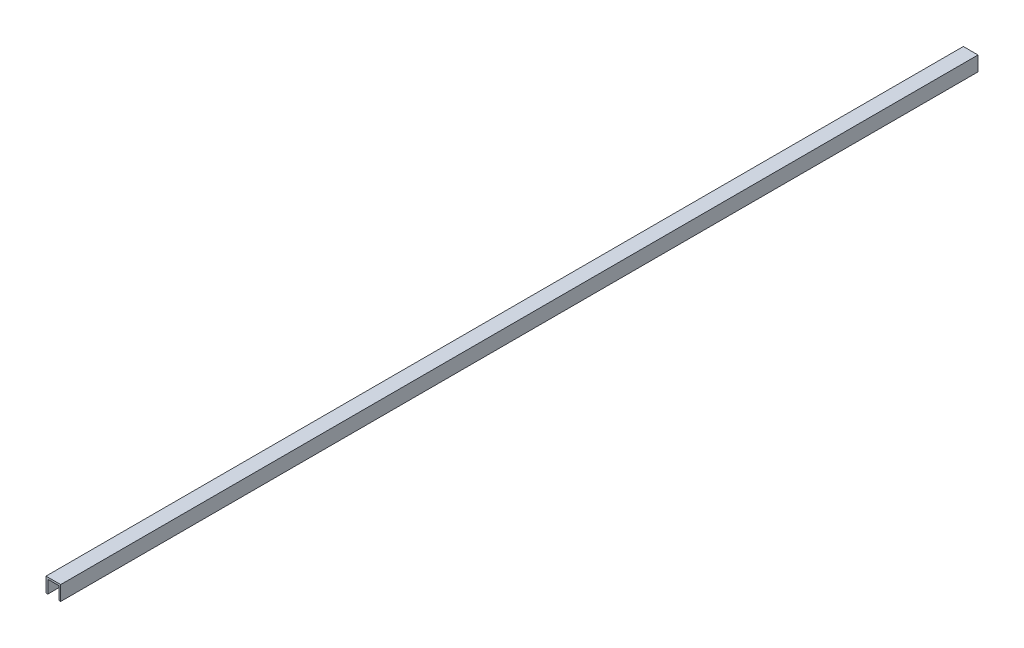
from build123d import *

# Parameters (mm, degrees)
SKIZZE1_W                       = 8
SKIZZE1_H                       = 8
AUFSATZ_LINEAR_AUSTRAGEN1_DEPTH = 250
WANDUNG1_T                      = -1


with BuildPart() as part:
    # Skizze1 → Aufsatz-Linear austragen1 (new, symmetric)
    with BuildSketch(Plane.XY):
        Rectangle(SKIZZE1_W, SKIZZE1_H)
    extrude(amount=AUFSATZ_LINEAR_AUSTRAGEN1_DEPTH, both=True)

    # Wandung1
    wandung1_openings = [part.faces().sort_by_distance(p)[0] for p in [
        (0, 0, 250),
        (0, 0, -250),
        (0, -4, 0),
    ]]
    offset(amount=WANDUNG1_T, openings=wandung1_openings, kind=Kind.INTERSECTION)


solid = part.part
